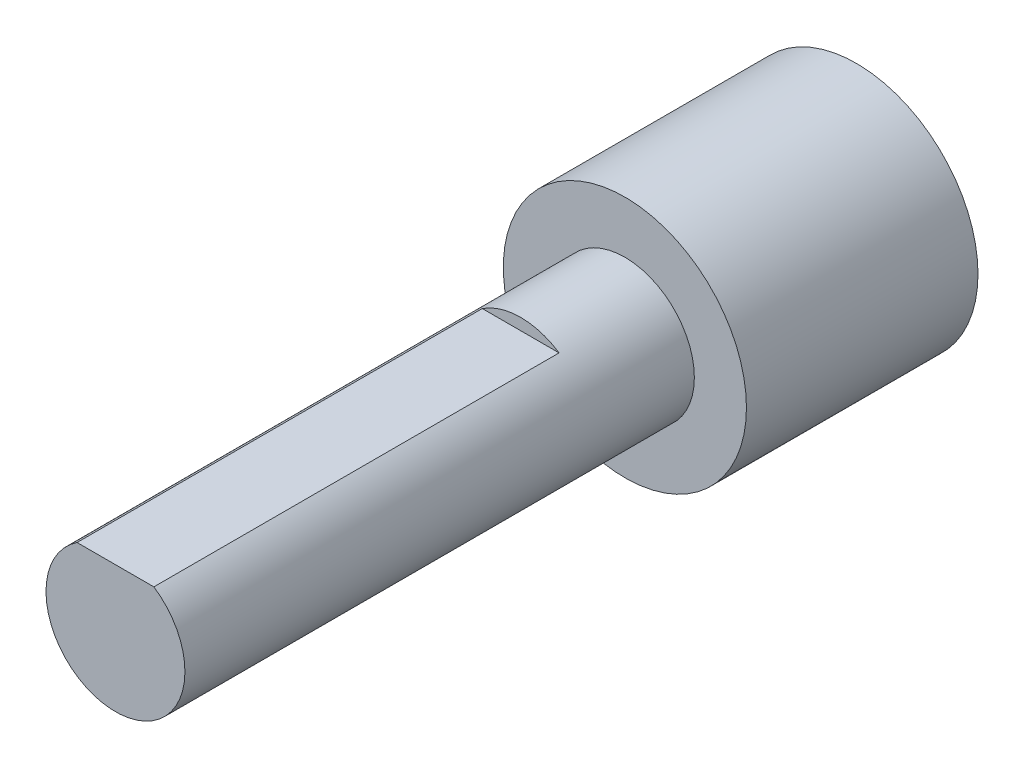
ISO-10303-21;
HEADER;
FILE_DESCRIPTION(('STEP AP214'),'2;1');
FILE_NAME('part.step','',(''),(''),'','','');
FILE_SCHEMA(('AUTOMOTIVE_DESIGN { 1 0 10303 214 1 1 1 1 }'));
ENDSEC;
DATA;
#1=APPLICATION_CONTEXT('core data for automotive mechanical design processes');
#2=APPLICATION_PROTOCOL_DEFINITION('international standard','automotive_design',2000,#1);
#3=PRODUCT_CONTEXT('',#1,'mechanical');
#4=PRODUCT('Part','Part','',(#3));
#5=PRODUCT_RELATED_PRODUCT_CATEGORY('part','',(#4));
#6=PRODUCT_DEFINITION_FORMATION('','',#4);
#7=PRODUCT_DEFINITION_CONTEXT('part definition',#1,'design');
#8=PRODUCT_DEFINITION('design','',#6,#7);
#9=PRODUCT_DEFINITION_SHAPE('','',#8);
#10=(LENGTH_UNIT() NAMED_UNIT(*) SI_UNIT(.MILLI.,.METRE.));
#11=(NAMED_UNIT(*) PLANE_ANGLE_UNIT() SI_UNIT($,.RADIAN.));
#12=(NAMED_UNIT(*) SI_UNIT($,.STERADIAN.) SOLID_ANGLE_UNIT());
#13=UNCERTAINTY_MEASURE_WITH_UNIT(LENGTH_MEASURE(1.E-05),#10,'distance_accuracy_value','');
#14=(GEOMETRIC_REPRESENTATION_CONTEXT(3) GLOBAL_UNCERTAINTY_ASSIGNED_CONTEXT((#13)) GLOBAL_UNIT_ASSIGNED_CONTEXT((#10,
#11,#12)) REPRESENTATION_CONTEXT('',''));
#15=CARTESIAN_POINT('',(0.,0.,0.));
#16=DIRECTION('',(0.,0.,1.));
#17=DIRECTION('',(1.,0.,0.));
#18=AXIS2_PLACEMENT_3D('',#15,#16,#17);
#19=CARTESIAN_POINT('',(0.,0.,10.));
#20=DIRECTION('',(0.,0.,-1.));
#21=DIRECTION('',(-1.,0.,0.));
#22=AXIS2_PLACEMENT_3D('',#19,#20,#21);
#23=CYLINDRICAL_SURFACE('',#22,5.25);
#24=CARTESIAN_POINT('',(0.,0.,10.));
#25=DIRECTION('',(0.,0.,1.));
#26=DIRECTION('',(1.,0.,0.));
#27=AXIS2_PLACEMENT_3D('',#24,#25,#26);
#28=CIRCLE('',#27,5.25);
#29=CARTESIAN_POINT('',(5.25,0.,10.));
#30=VERTEX_POINT('',#29);
#31=EDGE_CURVE('E77',#30,#30,#28,.T.);
#32=ORIENTED_EDGE('',*,*,#31,.F.);
#33=EDGE_LOOP('',(#32));
#34=FACE_BOUND('',#33,.T.);
#35=CARTESIAN_POINT('',(0.,0.,0.));
#36=DIRECTION('',(0.,0.,1.));
#37=DIRECTION('',(1.,0.,0.));
#38=AXIS2_PLACEMENT_3D('',#35,#36,#37);
#39=CIRCLE('',#38,5.25);
#40=CARTESIAN_POINT('',(5.25,0.,0.));
#41=VERTEX_POINT('',#40);
#42=EDGE_CURVE('E74',#41,#41,#39,.T.);
#43=ORIENTED_EDGE('',*,*,#42,.T.);
#44=EDGE_LOOP('',(#43));
#45=FACE_BOUND('',#44,.T.);
#46=ADVANCED_FACE('F37',(#34,#45),#23,.T.);
#47=CARTESIAN_POINT('',(0.,0.,10.));
#48=DIRECTION('',(0.,0.,1.));
#49=DIRECTION('',(1.,0.,0.));
#50=AXIS2_PLACEMENT_3D('',#47,#48,#49);
#51=PLANE('',#50);
#52=CARTESIAN_POINT('',(0.,0.,10.));
#53=DIRECTION('',(0.,0.,1.));
#54=DIRECTION('',(1.,0.,0.));
#55=AXIS2_PLACEMENT_3D('',#52,#53,#54);
#56=CIRCLE('',#55,3.);
#57=CARTESIAN_POINT('',(3.,0.,10.));
#58=VERTEX_POINT('',#57);
#59=EDGE_CURVE('E65',#58,#58,#56,.T.);
#60=ORIENTED_EDGE('',*,*,#59,.F.);
#61=EDGE_LOOP('',(#60));
#62=FACE_BOUND('',#61,.T.);
#63=ORIENTED_EDGE('',*,*,#31,.T.);
#64=EDGE_LOOP('',(#63));
#65=FACE_BOUND('',#64,.T.);
#66=ADVANCED_FACE('F86',(#62,#65),#51,.T.);
#67=CARTESIAN_POINT('',(0.,0.,0.));
#68=DIRECTION('',(0.,0.,1.));
#69=DIRECTION('',(1.,0.,0.));
#70=AXIS2_PLACEMENT_3D('',#67,#68,#69);
#71=PLANE('',#70);
#72=ORIENTED_EDGE('',*,*,#42,.F.);
#73=EDGE_LOOP('',(#72));
#74=FACE_BOUND('',#73,.T.);
#75=ADVANCED_FACE('F92',(#74),#71,.F.);
#76=CARTESIAN_POINT('',(0.,0.,32.));
#77=DIRECTION('',(0.,0.,-1.));
#78=DIRECTION('',(-1.,0.,0.));
#79=AXIS2_PLACEMENT_3D('',#76,#77,#78);
#80=CYLINDRICAL_SURFACE('',#79,3.);
#81=CARTESIAN_POINT('',(0.,0.,32.));
#82=DIRECTION('',(0.,0.,1.));
#83=DIRECTION('',(1.,0.,0.));
#84=AXIS2_PLACEMENT_3D('',#81,#82,#83);
#85=CIRCLE('',#84,3.);
#86=CARTESIAN_POINT('',(-1.6583123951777,2.5,32.));
#87=VERTEX_POINT('',#86);
#88=CARTESIAN_POINT('',(1.6583123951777,2.5,32.));
#89=VERTEX_POINT('',#88);
#90=EDGE_CURVE('E70',#87,#89,#85,.T.);
#91=ORIENTED_EDGE('',*,*,#90,.F.);
#92=DIRECTION('',(0.,0.,-1.));
#93=VECTOR('',#92,1.);
#94=CARTESIAN_POINT('',(-1.6583123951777,2.5,32.));
#95=LINE('',#94,#93);
#96=CARTESIAN_POINT('',(-1.6583123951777,2.5,14.5));
#97=VERTEX_POINT('',#96);
#98=EDGE_CURVE('E51',#87,#97,#95,.T.);
#99=ORIENTED_EDGE('',*,*,#98,.T.);
#100=CARTESIAN_POINT('',(0.,0.,14.5));
#101=DIRECTION('',(0.,0.,1.));
#102=DIRECTION('',(1.,0.,0.));
#103=AXIS2_PLACEMENT_3D('',#100,#101,#102);
#104=CIRCLE('',#103,3.);
#105=CARTESIAN_POINT('',(1.6583123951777,2.5,14.5));
#106=VERTEX_POINT('',#105);
#107=EDGE_CURVE('E11',#106,#97,#104,.T.);
#108=ORIENTED_EDGE('',*,*,#107,.F.);
#109=DIRECTION('',(0.,0.,-1.));
#110=VECTOR('',#109,1.);
#111=CARTESIAN_POINT('',(1.6583123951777,2.5,32.));
#112=LINE('',#111,#110);
#113=EDGE_CURVE('E56',#106,#89,#112,.F.);
#114=ORIENTED_EDGE('',*,*,#113,.T.);
#115=EDGE_LOOP('',(#91,#99,#108,#114));
#116=FACE_BOUND('',#115,.T.);
#117=ORIENTED_EDGE('',*,*,#59,.T.);
#118=EDGE_LOOP('',(#117));
#119=FACE_BOUND('',#118,.T.);
#120=ADVANCED_FACE('F68',(#116,#119),#80,.T.);
#121=CARTESIAN_POINT('',(0.,0.,32.));
#122=DIRECTION('',(0.,0.,1.));
#123=DIRECTION('',(1.,0.,0.));
#124=AXIS2_PLACEMENT_3D('',#121,#122,#123);
#125=PLANE('',#124);
#126=DIRECTION('',(1.,0.,0.));
#127=VECTOR('',#126,1.);
#128=CARTESIAN_POINT('',(0.,2.5,32.));
#129=LINE('',#128,#127);
#130=EDGE_CURVE('E44',#87,#89,#129,.T.);
#131=ORIENTED_EDGE('',*,*,#130,.F.);
#132=ORIENTED_EDGE('',*,*,#90,.T.);
#133=EDGE_LOOP('',(#131,#132));
#134=FACE_BOUND('',#133,.T.);
#135=ADVANCED_FACE('F73',(#134),#125,.T.);
#136=CARTESIAN_POINT('',(0.,0.,14.5));
#137=DIRECTION('',(0.,0.,1.));
#138=DIRECTION('',(1.,0.,0.));
#139=AXIS2_PLACEMENT_3D('',#136,#137,#138);
#140=PLANE('',#139);
#141=ORIENTED_EDGE('',*,*,#107,.T.);
#142=DIRECTION('',(1.,0.,0.));
#143=VECTOR('',#142,1.);
#144=CARTESIAN_POINT('',(-3.,2.5,14.5));
#145=LINE('',#144,#143);
#146=EDGE_CURVE('E71',#97,#106,#145,.T.);
#147=ORIENTED_EDGE('',*,*,#146,.T.);
#148=EDGE_LOOP('',(#141,#147));
#149=FACE_BOUND('',#148,.T.);
#150=ADVANCED_FACE('F104',(#149),#140,.T.);
#151=CARTESIAN_POINT('',(-3.,2.5,14.5));
#152=DIRECTION('',(0.,-1.,0.));
#153=DIRECTION('',(0.,0.,-1.));
#154=AXIS2_PLACEMENT_3D('',#151,#152,#153);
#155=PLANE('',#154);
#156=ORIENTED_EDGE('',*,*,#130,.T.);
#157=ORIENTED_EDGE('',*,*,#113,.F.);
#158=ORIENTED_EDGE('',*,*,#146,.F.);
#159=ORIENTED_EDGE('',*,*,#98,.F.);
#160=EDGE_LOOP('',(#156,#157,#158,#159));
#161=FACE_BOUND('',#160,.T.);
#162=ADVANCED_FACE('F61',(#161),#155,.F.);
#163=CLOSED_SHELL('',(#46,#66,#75,#120,#135,#150,#162));
#164=MANIFOLD_SOLID_BREP('B2',#163);
#165=ADVANCED_BREP_SHAPE_REPRESENTATION('',(#18,#164),#14);
#166=SHAPE_DEFINITION_REPRESENTATION(#9,#165);
ENDSEC;
END-ISO-10303-21;
